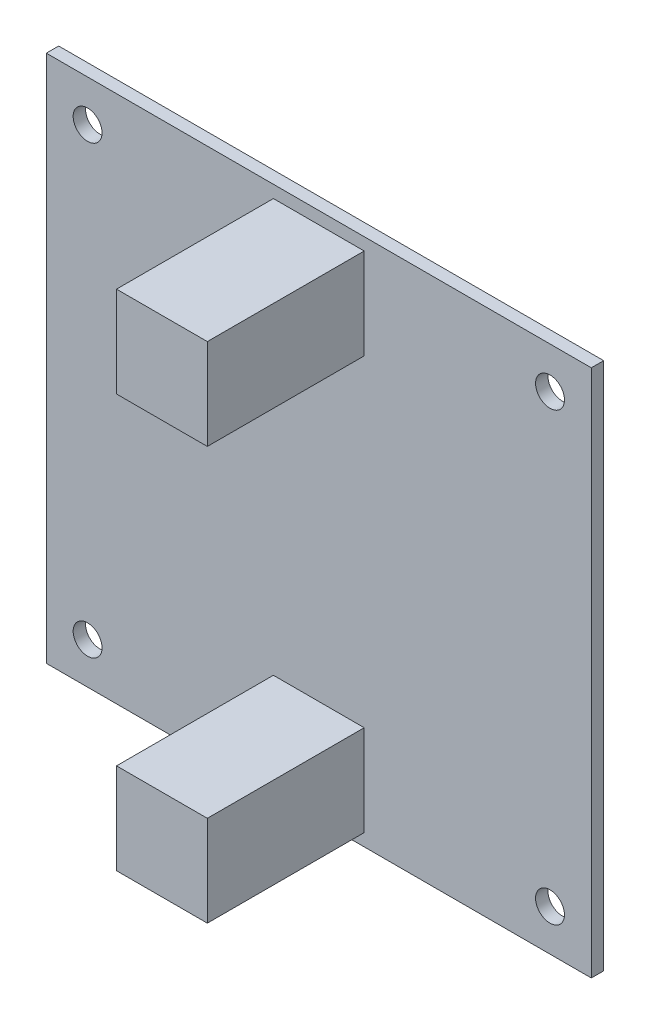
ISO-10303-21;
HEADER;
FILE_DESCRIPTION(('STEP AP214'),'2;1');
FILE_NAME('part.step','',(''),(''),'','','');
FILE_SCHEMA(('AUTOMOTIVE_DESIGN { 1 0 10303 214 1 1 1 1 }'));
ENDSEC;
DATA;
#1=APPLICATION_CONTEXT('core data for automotive mechanical design processes');
#2=APPLICATION_PROTOCOL_DEFINITION('international standard','automotive_design',2000,#1);
#3=PRODUCT_CONTEXT('',#1,'mechanical');
#4=PRODUCT('Part','Part','',(#3));
#5=PRODUCT_RELATED_PRODUCT_CATEGORY('part','',(#4));
#6=PRODUCT_DEFINITION_FORMATION('','',#4);
#7=PRODUCT_DEFINITION_CONTEXT('part definition',#1,'design');
#8=PRODUCT_DEFINITION('design','',#6,#7);
#9=PRODUCT_DEFINITION_SHAPE('','',#8);
#10=(LENGTH_UNIT() NAMED_UNIT(*) SI_UNIT(.MILLI.,.METRE.));
#11=(NAMED_UNIT(*) PLANE_ANGLE_UNIT() SI_UNIT($,.RADIAN.));
#12=(NAMED_UNIT(*) SI_UNIT($,.STERADIAN.) SOLID_ANGLE_UNIT());
#13=UNCERTAINTY_MEASURE_WITH_UNIT(LENGTH_MEASURE(1.E-05),#10,'distance_accuracy_value','');
#14=(GEOMETRIC_REPRESENTATION_CONTEXT(3) GLOBAL_UNCERTAINTY_ASSIGNED_CONTEXT((#13)) GLOBAL_UNIT_ASSIGNED_CONTEXT((#10,
#11,#12)) REPRESENTATION_CONTEXT('',''));
#15=CARTESIAN_POINT('',(0.,0.,0.));
#16=DIRECTION('',(0.,0.,1.));
#17=DIRECTION('',(1.,0.,0.));
#18=AXIS2_PLACEMENT_3D('',#15,#16,#17);
#19=CARTESIAN_POINT('',(0.,0.,1.5));
#20=DIRECTION('',(0.,0.,1.));
#21=DIRECTION('',(1.,0.,0.));
#22=AXIS2_PLACEMENT_3D('',#19,#20,#21);
#23=PLANE('',#22);
#24=DIRECTION('',(0.,-1.,0.));
#25=VECTOR('',#24,1.);
#26=CARTESIAN_POINT('',(5.49999999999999,-30.5,1.5));
#27=LINE('',#26,#25);
#28=CARTESIAN_POINT('',(5.5,-19.5,1.5));
#29=VERTEX_POINT('',#28);
#30=CARTESIAN_POINT('',(5.49999999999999,-30.5,1.5));
#31=VERTEX_POINT('',#30);
#32=EDGE_CURVE('E130',#29,#31,#27,.T.);
#33=ORIENTED_EDGE('',*,*,#32,.T.);
#34=DIRECTION('',(-1.,0.,0.));
#35=VECTOR('',#34,1.);
#36=CARTESIAN_POINT('',(-5.50000000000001,-30.5,1.5));
#37=LINE('',#36,#35);
#38=CARTESIAN_POINT('',(-5.50000000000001,-30.5,1.5));
#39=VERTEX_POINT('',#38);
#40=EDGE_CURVE('E144',#31,#39,#37,.T.);
#41=ORIENTED_EDGE('',*,*,#40,.T.);
#42=DIRECTION('',(0.,1.,0.));
#43=VECTOR('',#42,1.);
#44=CARTESIAN_POINT('',(-5.50000000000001,-30.5,1.5));
#45=LINE('',#44,#43);
#46=CARTESIAN_POINT('',(-5.50000000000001,-19.5,1.5));
#47=VERTEX_POINT('',#46);
#48=EDGE_CURVE('E56',#39,#47,#45,.T.);
#49=ORIENTED_EDGE('',*,*,#48,.T.);
#50=DIRECTION('',(1.,0.,0.));
#51=VECTOR('',#50,1.);
#52=CARTESIAN_POINT('',(-5.50000000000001,-19.5,1.5));
#53=LINE('',#52,#51);
#54=EDGE_CURVE('E51',#47,#29,#53,.T.);
#55=ORIENTED_EDGE('',*,*,#54,.T.);
#56=EDGE_LOOP('',(#33,#41,#49,#55));
#57=FACE_BOUND('',#56,.T.);
#58=CARTESIAN_POINT('',(-28.,-27.,1.5));
#59=DIRECTION('',(0.,0.,1.));
#60=DIRECTION('',(-1.,0.,0.));
#61=AXIS2_PLACEMENT_3D('',#58,#59,#60);
#62=CIRCLE('',#61,1.75);
#63=CARTESIAN_POINT('',(-29.75,-27.,1.5));
#64=VERTEX_POINT('',#63);
#65=EDGE_CURVE('E190',#64,#64,#62,.T.);
#66=ORIENTED_EDGE('',*,*,#65,.F.);
#67=EDGE_LOOP('',(#66));
#68=FACE_BOUND('',#67,.T.);
#69=CARTESIAN_POINT('',(28.,-27.,1.5));
#70=DIRECTION('',(0.,0.,1.));
#71=DIRECTION('',(1.,0.,0.));
#72=AXIS2_PLACEMENT_3D('',#69,#70,#71);
#73=CIRCLE('',#72,1.75);
#74=CARTESIAN_POINT('',(29.75,-27.,1.5));
#75=VERTEX_POINT('',#74);
#76=EDGE_CURVE('E199',#75,#75,#73,.T.);
#77=ORIENTED_EDGE('',*,*,#76,.F.);
#78=EDGE_LOOP('',(#77));
#79=FACE_BOUND('',#78,.T.);
#80=CARTESIAN_POINT('',(28.,27.,1.5));
#81=DIRECTION('',(0.,0.,1.));
#82=DIRECTION('',(-1.,0.,0.));
#83=AXIS2_PLACEMENT_3D('',#80,#81,#82);
#84=CIRCLE('',#83,1.75);
#85=CARTESIAN_POINT('',(26.25,27.,1.5));
#86=VERTEX_POINT('',#85);
#87=EDGE_CURVE('E191',#86,#86,#84,.T.);
#88=ORIENTED_EDGE('',*,*,#87,.F.);
#89=EDGE_LOOP('',(#88));
#90=FACE_BOUND('',#89,.T.);
#91=CARTESIAN_POINT('',(-28.,27.,1.5));
#92=DIRECTION('',(0.,0.,1.));
#93=DIRECTION('',(1.,0.,0.));
#94=AXIS2_PLACEMENT_3D('',#91,#92,#93);
#95=CIRCLE('',#94,1.75);
#96=CARTESIAN_POINT('',(-26.25,27.,1.5));
#97=VERTEX_POINT('',#96);
#98=EDGE_CURVE('E198',#97,#97,#95,.T.);
#99=ORIENTED_EDGE('',*,*,#98,.F.);
#100=EDGE_LOOP('',(#99));
#101=FACE_BOUND('',#100,.T.);
#102=DIRECTION('',(0.,1.,0.));
#103=VECTOR('',#102,1.);
#104=CARTESIAN_POINT('',(33.,32.,1.5));
#105=LINE('',#104,#103);
#106=CARTESIAN_POINT('',(33.,-32.,1.5));
#107=VERTEX_POINT('',#106);
#108=CARTESIAN_POINT('',(33.,32.,1.5));
#109=VERTEX_POINT('',#108);
#110=EDGE_CURVE('E215',#107,#109,#105,.T.);
#111=ORIENTED_EDGE('',*,*,#110,.T.);
#112=DIRECTION('',(-1.,0.,0.));
#113=VECTOR('',#112,1.);
#114=CARTESIAN_POINT('',(-33.,32.,1.5));
#115=LINE('',#114,#113);
#116=CARTESIAN_POINT('',(-33.,32.,1.5));
#117=VERTEX_POINT('',#116);
#118=EDGE_CURVE('E218',#109,#117,#115,.T.);
#119=ORIENTED_EDGE('',*,*,#118,.T.);
#120=DIRECTION('',(0.,-1.,0.));
#121=VECTOR('',#120,1.);
#122=CARTESIAN_POINT('',(-33.,32.,1.5));
#123=LINE('',#122,#121);
#124=CARTESIAN_POINT('',(-33.,-32.,1.5));
#125=VERTEX_POINT('',#124);
#126=EDGE_CURVE('E221',#117,#125,#123,.T.);
#127=ORIENTED_EDGE('',*,*,#126,.T.);
#128=DIRECTION('',(1.,0.,0.));
#129=VECTOR('',#128,1.);
#130=CARTESIAN_POINT('',(-33.,-32.,1.5));
#131=LINE('',#130,#129);
#132=EDGE_CURVE('E223',#125,#107,#131,.T.);
#133=ORIENTED_EDGE('',*,*,#132,.T.);
#134=EDGE_LOOP('',(#111,#119,#127,#133));
#135=FACE_BOUND('',#134,.T.);
#136=DIRECTION('',(-1.,0.,0.));
#137=VECTOR('',#136,1.);
#138=CARTESIAN_POINT('',(-5.50000000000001,30.5,1.5));
#139=LINE('',#138,#137);
#140=CARTESIAN_POINT('',(5.49999999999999,30.5,1.5));
#141=VERTEX_POINT('',#140);
#142=CARTESIAN_POINT('',(-5.50000000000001,30.5,1.5));
#143=VERTEX_POINT('',#142);
#144=EDGE_CURVE('E175',#141,#143,#139,.T.);
#145=ORIENTED_EDGE('',*,*,#144,.F.);
#146=DIRECTION('',(0.,1.,0.));
#147=VECTOR('',#146,1.);
#148=CARTESIAN_POINT('',(5.49999999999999,30.5,1.5));
#149=LINE('',#148,#147);
#150=CARTESIAN_POINT('',(5.5,19.5,1.5));
#151=VERTEX_POINT('',#150);
#152=EDGE_CURVE('E133',#151,#141,#149,.T.);
#153=ORIENTED_EDGE('',*,*,#152,.F.);
#154=DIRECTION('',(1.,0.,0.));
#155=VECTOR('',#154,1.);
#156=CARTESIAN_POINT('',(-5.50000000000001,19.5,1.5));
#157=LINE('',#156,#155);
#158=CARTESIAN_POINT('',(-5.50000000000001,19.5,1.5));
#159=VERTEX_POINT('',#158);
#160=EDGE_CURVE('E166',#159,#151,#157,.T.);
#161=ORIENTED_EDGE('',*,*,#160,.F.);
#162=DIRECTION('',(0.,-1.,0.));
#163=VECTOR('',#162,1.);
#164=CARTESIAN_POINT('',(-5.50000000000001,30.5,1.5));
#165=LINE('',#164,#163);
#166=EDGE_CURVE('E177',#143,#159,#165,.T.);
#167=ORIENTED_EDGE('',*,*,#166,.F.);
#168=EDGE_LOOP('',(#145,#153,#161,#167));
#169=FACE_BOUND('',#168,.T.);
#170=ADVANCED_FACE('F36',(#57,#68,#79,#90,#101,#135,#169),#23,.T.);
#171=CARTESIAN_POINT('',(33.,32.,1.5));
#172=DIRECTION('',(-1.,0.,0.));
#173=DIRECTION('',(0.,-1.,0.));
#174=AXIS2_PLACEMENT_3D('',#171,#172,#173);
#175=PLANE('',#174);
#176=DIRECTION('',(0.,1.,0.));
#177=VECTOR('',#176,1.);
#178=CARTESIAN_POINT('',(33.,32.,0.));
#179=LINE('',#178,#177);
#180=CARTESIAN_POINT('',(33.,-32.,0.));
#181=VERTEX_POINT('',#180);
#182=CARTESIAN_POINT('',(33.,32.,0.));
#183=VERTEX_POINT('',#182);
#184=EDGE_CURVE('E214',#181,#183,#179,.T.);
#185=ORIENTED_EDGE('',*,*,#184,.T.);
#186=DIRECTION('',(0.,0.,-1.));
#187=VECTOR('',#186,1.);
#188=CARTESIAN_POINT('',(33.,32.,1.5));
#189=LINE('',#188,#187);
#190=EDGE_CURVE('E11',#109,#183,#189,.T.);
#191=ORIENTED_EDGE('',*,*,#190,.F.);
#192=ORIENTED_EDGE('',*,*,#110,.F.);
#193=DIRECTION('',(0.,0.,-1.));
#194=VECTOR('',#193,1.);
#195=CARTESIAN_POINT('',(33.,-32.,1.5));
#196=LINE('',#195,#194);
#197=EDGE_CURVE('E225',#107,#181,#196,.T.);
#198=ORIENTED_EDGE('',*,*,#197,.T.);
#199=EDGE_LOOP('',(#185,#191,#192,#198));
#200=FACE_BOUND('',#199,.T.);
#201=ADVANCED_FACE('F38',(#200),#175,.F.);
#202=CARTESIAN_POINT('',(-33.,32.,1.5));
#203=DIRECTION('',(0.,-1.,0.));
#204=DIRECTION('',(0.,0.,-1.));
#205=AXIS2_PLACEMENT_3D('',#202,#203,#204);
#206=PLANE('',#205);
#207=DIRECTION('',(-1.,0.,0.));
#208=VECTOR('',#207,1.);
#209=CARTESIAN_POINT('',(-33.,32.,0.));
#210=LINE('',#209,#208);
#211=CARTESIAN_POINT('',(-33.,32.,0.));
#212=VERTEX_POINT('',#211);
#213=EDGE_CURVE('E228',#183,#212,#210,.T.);
#214=ORIENTED_EDGE('',*,*,#213,.T.);
#215=DIRECTION('',(0.,0.,-1.));
#216=VECTOR('',#215,1.);
#217=CARTESIAN_POINT('',(-33.,32.,1.5));
#218=LINE('',#217,#216);
#219=EDGE_CURVE('E44',#117,#212,#218,.T.);
#220=ORIENTED_EDGE('',*,*,#219,.F.);
#221=ORIENTED_EDGE('',*,*,#118,.F.);
#222=ORIENTED_EDGE('',*,*,#190,.T.);
#223=EDGE_LOOP('',(#214,#220,#221,#222));
#224=FACE_BOUND('',#223,.T.);
#225=ADVANCED_FACE('F258',(#224),#206,.F.);
#226=CARTESIAN_POINT('',(-33.,32.,1.5));
#227=DIRECTION('',(1.,0.,0.));
#228=DIRECTION('',(0.,1.,0.));
#229=AXIS2_PLACEMENT_3D('',#226,#227,#228);
#230=PLANE('',#229);
#231=DIRECTION('',(0.,-1.,0.));
#232=VECTOR('',#231,1.);
#233=CARTESIAN_POINT('',(-33.,32.,0.));
#234=LINE('',#233,#232);
#235=CARTESIAN_POINT('',(-33.,-32.,0.));
#236=VERTEX_POINT('',#235);
#237=EDGE_CURVE('E230',#212,#236,#234,.T.);
#238=ORIENTED_EDGE('',*,*,#237,.T.);
#239=DIRECTION('',(0.,0.,-1.));
#240=VECTOR('',#239,1.);
#241=CARTESIAN_POINT('',(-33.,-32.,1.5));
#242=LINE('',#241,#240);
#243=EDGE_CURVE('E235',#125,#236,#242,.T.);
#244=ORIENTED_EDGE('',*,*,#243,.F.);
#245=ORIENTED_EDGE('',*,*,#126,.F.);
#246=ORIENTED_EDGE('',*,*,#219,.T.);
#247=EDGE_LOOP('',(#238,#244,#245,#246));
#248=FACE_BOUND('',#247,.T.);
#249=ADVANCED_FACE('F242',(#248),#230,.F.);
#250=CARTESIAN_POINT('',(-33.,-32.,1.5));
#251=DIRECTION('',(0.,1.,0.));
#252=DIRECTION('',(0.,0.,1.));
#253=AXIS2_PLACEMENT_3D('',#250,#251,#252);
#254=PLANE('',#253);
#255=DIRECTION('',(1.,0.,0.));
#256=VECTOR('',#255,1.);
#257=CARTESIAN_POINT('',(-33.,-32.,0.));
#258=LINE('',#257,#256);
#259=EDGE_CURVE('E219',#236,#181,#258,.T.);
#260=ORIENTED_EDGE('',*,*,#259,.T.);
#261=ORIENTED_EDGE('',*,*,#197,.F.);
#262=ORIENTED_EDGE('',*,*,#132,.F.);
#263=ORIENTED_EDGE('',*,*,#243,.T.);
#264=EDGE_LOOP('',(#260,#261,#262,#263));
#265=FACE_BOUND('',#264,.T.);
#266=ADVANCED_FACE('F251',(#265),#254,.F.);
#267=CARTESIAN_POINT('',(0.,0.,0.));
#268=DIRECTION('',(0.,0.,1.));
#269=DIRECTION('',(1.,0.,0.));
#270=AXIS2_PLACEMENT_3D('',#267,#268,#269);
#271=PLANE('',#270);
#272=CARTESIAN_POINT('',(-28.,-27.,0.));
#273=DIRECTION('',(0.,0.,1.));
#274=DIRECTION('',(1.,0.,0.));
#275=AXIS2_PLACEMENT_3D('',#272,#273,#274);
#276=CIRCLE('',#275,1.75);
#277=CARTESIAN_POINT('',(-26.25,-27.,0.));
#278=VERTEX_POINT('',#277);
#279=EDGE_CURVE('E202',#278,#278,#276,.F.);
#280=ORIENTED_EDGE('',*,*,#279,.F.);
#281=EDGE_LOOP('',(#280));
#282=FACE_BOUND('',#281,.T.);
#283=CARTESIAN_POINT('',(28.,-27.,0.));
#284=DIRECTION('',(0.,0.,1.));
#285=DIRECTION('',(1.,0.,0.));
#286=AXIS2_PLACEMENT_3D('',#283,#284,#285);
#287=CIRCLE('',#286,1.75);
#288=CARTESIAN_POINT('',(29.75,-27.,0.));
#289=VERTEX_POINT('',#288);
#290=EDGE_CURVE('E195',#289,#289,#287,.F.);
#291=ORIENTED_EDGE('',*,*,#290,.F.);
#292=EDGE_LOOP('',(#291));
#293=FACE_BOUND('',#292,.T.);
#294=CARTESIAN_POINT('',(28.,27.,0.));
#295=DIRECTION('',(0.,0.,1.));
#296=DIRECTION('',(1.,0.,0.));
#297=AXIS2_PLACEMENT_3D('',#294,#295,#296);
#298=CIRCLE('',#297,1.75);
#299=CARTESIAN_POINT('',(29.75,27.,0.));
#300=VERTEX_POINT('',#299);
#301=EDGE_CURVE('E194',#300,#300,#298,.F.);
#302=ORIENTED_EDGE('',*,*,#301,.F.);
#303=EDGE_LOOP('',(#302));
#304=FACE_BOUND('',#303,.T.);
#305=CARTESIAN_POINT('',(-28.,27.,0.));
#306=DIRECTION('',(0.,0.,1.));
#307=DIRECTION('',(1.,0.,0.));
#308=AXIS2_PLACEMENT_3D('',#305,#306,#307);
#309=CIRCLE('',#308,1.75);
#310=CARTESIAN_POINT('',(-26.25,27.,0.));
#311=VERTEX_POINT('',#310);
#312=EDGE_CURVE('E211',#311,#311,#309,.F.);
#313=ORIENTED_EDGE('',*,*,#312,.F.);
#314=EDGE_LOOP('',(#313));
#315=FACE_BOUND('',#314,.T.);
#316=ORIENTED_EDGE('',*,*,#184,.F.);
#317=ORIENTED_EDGE('',*,*,#259,.F.);
#318=ORIENTED_EDGE('',*,*,#237,.F.);
#319=ORIENTED_EDGE('',*,*,#213,.F.);
#320=EDGE_LOOP('',(#316,#317,#318,#319));
#321=FACE_BOUND('',#320,.T.);
#322=ADVANCED_FACE('F248',(#282,#293,#304,#315,#321),#271,.F.);
#323=CARTESIAN_POINT('',(-28.,27.,-0.000999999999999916));
#324=DIRECTION('',(0.,0.,1.));
#325=DIRECTION('',(1.,0.,0.));
#326=AXIS2_PLACEMENT_3D('',#323,#324,#325);
#327=CYLINDRICAL_SURFACE('',#326,1.75);
#328=ORIENTED_EDGE('',*,*,#98,.T.);
#329=EDGE_LOOP('',(#328));
#330=FACE_BOUND('',#329,.T.);
#331=ORIENTED_EDGE('',*,*,#312,.T.);
#332=EDGE_LOOP('',(#331));
#333=FACE_BOUND('',#332,.T.);
#334=ADVANCED_FACE('F272',(#330,#333),#327,.F.);
#335=CARTESIAN_POINT('',(28.,27.,-0.000999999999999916));
#336=DIRECTION('',(0.,0.,1.));
#337=DIRECTION('',(1.,0.,0.));
#338=AXIS2_PLACEMENT_3D('',#335,#336,#337);
#339=CYLINDRICAL_SURFACE('',#338,1.75);
#340=ORIENTED_EDGE('',*,*,#87,.T.);
#341=EDGE_LOOP('',(#340));
#342=FACE_BOUND('',#341,.T.);
#343=ORIENTED_EDGE('',*,*,#301,.T.);
#344=EDGE_LOOP('',(#343));
#345=FACE_BOUND('',#344,.T.);
#346=ADVANCED_FACE('F292',(#342,#345),#339,.F.);
#347=CARTESIAN_POINT('',(28.,-27.,-0.000999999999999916));
#348=DIRECTION('',(0.,0.,1.));
#349=DIRECTION('',(1.,0.,0.));
#350=AXIS2_PLACEMENT_3D('',#347,#348,#349);
#351=CYLINDRICAL_SURFACE('',#350,1.75);
#352=ORIENTED_EDGE('',*,*,#76,.T.);
#353=EDGE_LOOP('',(#352));
#354=FACE_BOUND('',#353,.T.);
#355=ORIENTED_EDGE('',*,*,#290,.T.);
#356=EDGE_LOOP('',(#355));
#357=FACE_BOUND('',#356,.T.);
#358=ADVANCED_FACE('F299',(#354,#357),#351,.F.);
#359=CARTESIAN_POINT('',(-28.,-27.,-0.000999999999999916));
#360=DIRECTION('',(0.,0.,1.));
#361=DIRECTION('',(1.,0.,0.));
#362=AXIS2_PLACEMENT_3D('',#359,#360,#361);
#363=CYLINDRICAL_SURFACE('',#362,1.75);
#364=ORIENTED_EDGE('',*,*,#65,.T.);
#365=EDGE_LOOP('',(#364));
#366=FACE_BOUND('',#365,.T.);
#367=ORIENTED_EDGE('',*,*,#279,.T.);
#368=EDGE_LOOP('',(#367));
#369=FACE_BOUND('',#368,.T.);
#370=ADVANCED_FACE('F307',(#366,#369),#363,.F.);
#371=CARTESIAN_POINT('',(5.49999999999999,30.5,20.5));
#372=DIRECTION('',(-1.,0.,0.));
#373=DIRECTION('',(0.,-1.,0.));
#374=AXIS2_PLACEMENT_3D('',#371,#372,#373);
#375=PLANE('',#374);
#376=ORIENTED_EDGE('',*,*,#152,.T.);
#377=DIRECTION('',(0.,0.,-1.));
#378=VECTOR('',#377,1.);
#379=CARTESIAN_POINT('',(5.49999999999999,30.5,20.5));
#380=LINE('',#379,#378);
#381=CARTESIAN_POINT('',(5.49999999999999,30.5,20.5));
#382=VERTEX_POINT('',#381);
#383=EDGE_CURVE('E188',#382,#141,#380,.T.);
#384=ORIENTED_EDGE('',*,*,#383,.F.);
#385=DIRECTION('',(0.,1.,0.));
#386=VECTOR('',#385,1.);
#387=CARTESIAN_POINT('',(5.49999999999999,30.5,20.5));
#388=LINE('',#387,#386);
#389=CARTESIAN_POINT('',(5.5,19.5,20.5));
#390=VERTEX_POINT('',#389);
#391=EDGE_CURVE('E162',#390,#382,#388,.T.);
#392=ORIENTED_EDGE('',*,*,#391,.F.);
#393=DIRECTION('',(0.,0.,-1.));
#394=VECTOR('',#393,1.);
#395=CARTESIAN_POINT('',(5.5,19.5,20.5));
#396=LINE('',#395,#394);
#397=EDGE_CURVE('E172',#390,#151,#396,.T.);
#398=ORIENTED_EDGE('',*,*,#397,.T.);
#399=EDGE_LOOP('',(#376,#384,#392,#398));
#400=FACE_BOUND('',#399,.T.);
#401=ADVANCED_FACE('F315',(#400),#375,.F.);
#402=CARTESIAN_POINT('',(-5.50000000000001,30.5,20.5));
#403=DIRECTION('',(0.,-1.,0.));
#404=DIRECTION('',(0.,0.,-1.));
#405=AXIS2_PLACEMENT_3D('',#402,#403,#404);
#406=PLANE('',#405);
#407=ORIENTED_EDGE('',*,*,#144,.T.);
#408=DIRECTION('',(0.,0.,-1.));
#409=VECTOR('',#408,1.);
#410=CARTESIAN_POINT('',(-5.50000000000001,30.5,20.5));
#411=LINE('',#410,#409);
#412=CARTESIAN_POINT('',(-5.50000000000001,30.5,20.5));
#413=VERTEX_POINT('',#412);
#414=EDGE_CURVE('E185',#413,#143,#411,.T.);
#415=ORIENTED_EDGE('',*,*,#414,.F.);
#416=DIRECTION('',(-1.,0.,0.));
#417=VECTOR('',#416,1.);
#418=CARTESIAN_POINT('',(-5.50000000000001,30.5,20.5));
#419=LINE('',#418,#417);
#420=EDGE_CURVE('E165',#382,#413,#419,.T.);
#421=ORIENTED_EDGE('',*,*,#420,.F.);
#422=ORIENTED_EDGE('',*,*,#383,.T.);
#423=EDGE_LOOP('',(#407,#415,#421,#422));
#424=FACE_BOUND('',#423,.T.);
#425=ADVANCED_FACE('F322',(#424),#406,.F.);
#426=CARTESIAN_POINT('',(-5.50000000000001,30.5,20.5));
#427=DIRECTION('',(1.,0.,0.));
#428=DIRECTION('',(0.,1.,0.));
#429=AXIS2_PLACEMENT_3D('',#426,#427,#428);
#430=PLANE('',#429);
#431=ORIENTED_EDGE('',*,*,#166,.T.);
#432=DIRECTION('',(0.,0.,-1.));
#433=VECTOR('',#432,1.);
#434=CARTESIAN_POINT('',(-5.50000000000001,19.5,20.5));
#435=LINE('',#434,#433);
#436=CARTESIAN_POINT('',(-5.50000000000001,19.5,20.5));
#437=VERTEX_POINT('',#436);
#438=EDGE_CURVE('E183',#437,#159,#435,.T.);
#439=ORIENTED_EDGE('',*,*,#438,.F.);
#440=DIRECTION('',(0.,-1.,0.));
#441=VECTOR('',#440,1.);
#442=CARTESIAN_POINT('',(-5.50000000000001,30.5,20.5));
#443=LINE('',#442,#441);
#444=EDGE_CURVE('E168',#413,#437,#443,.T.);
#445=ORIENTED_EDGE('',*,*,#444,.F.);
#446=ORIENTED_EDGE('',*,*,#414,.T.);
#447=EDGE_LOOP('',(#431,#439,#445,#446));
#448=FACE_BOUND('',#447,.T.);
#449=ADVANCED_FACE('F330',(#448),#430,.F.);
#450=CARTESIAN_POINT('',(-5.50000000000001,19.5,20.5));
#451=DIRECTION('',(0.,1.,0.));
#452=DIRECTION('',(0.,0.,1.));
#453=AXIS2_PLACEMENT_3D('',#450,#451,#452);
#454=PLANE('',#453);
#455=ORIENTED_EDGE('',*,*,#160,.T.);
#456=ORIENTED_EDGE('',*,*,#397,.F.);
#457=DIRECTION('',(1.,0.,0.));
#458=VECTOR('',#457,1.);
#459=CARTESIAN_POINT('',(-5.50000000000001,19.5,20.5));
#460=LINE('',#459,#458);
#461=EDGE_CURVE('E170',#437,#390,#460,.T.);
#462=ORIENTED_EDGE('',*,*,#461,.F.);
#463=ORIENTED_EDGE('',*,*,#438,.T.);
#464=EDGE_LOOP('',(#455,#456,#462,#463));
#465=FACE_BOUND('',#464,.T.);
#466=ADVANCED_FACE('F338',(#465),#454,.F.);
#467=CARTESIAN_POINT('',(0.,0.,20.5));
#468=DIRECTION('',(0.,0.,1.));
#469=DIRECTION('',(1.,0.,0.));
#470=AXIS2_PLACEMENT_3D('',#467,#468,#469);
#471=PLANE('',#470);
#472=ORIENTED_EDGE('',*,*,#391,.T.);
#473=ORIENTED_EDGE('',*,*,#420,.T.);
#474=ORIENTED_EDGE('',*,*,#444,.T.);
#475=ORIENTED_EDGE('',*,*,#461,.T.);
#476=EDGE_LOOP('',(#472,#473,#474,#475));
#477=FACE_BOUND('',#476,.T.);
#478=ADVANCED_FACE('F346',(#477),#471,.T.);
#479=CARTESIAN_POINT('',(5.49999999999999,-30.5,20.5));
#480=DIRECTION('',(1.,0.,0.));
#481=DIRECTION('',(0.,1.,0.));
#482=AXIS2_PLACEMENT_3D('',#479,#480,#481);
#483=PLANE('',#482);
#484=ORIENTED_EDGE('',*,*,#32,.F.);
#485=DIRECTION('',(0.,0.,-1.));
#486=VECTOR('',#485,1.);
#487=CARTESIAN_POINT('',(5.5,-19.5,20.5));
#488=LINE('',#487,#486);
#489=CARTESIAN_POINT('',(5.5,-19.5,20.5));
#490=VERTEX_POINT('',#489);
#491=EDGE_CURVE('E124',#490,#29,#488,.T.);
#492=ORIENTED_EDGE('',*,*,#491,.F.);
#493=DIRECTION('',(0.,-1.,0.));
#494=VECTOR('',#493,1.);
#495=CARTESIAN_POINT('',(5.49999999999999,-30.5,20.5));
#496=LINE('',#495,#494);
#497=CARTESIAN_POINT('',(5.49999999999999,-30.5,20.5));
#498=VERTEX_POINT('',#497);
#499=EDGE_CURVE('E128',#490,#498,#496,.T.);
#500=ORIENTED_EDGE('',*,*,#499,.T.);
#501=DIRECTION('',(0.,0.,-1.));
#502=VECTOR('',#501,1.);
#503=CARTESIAN_POINT('',(5.49999999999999,-30.5,20.5));
#504=LINE('',#503,#502);
#505=EDGE_CURVE('E152',#498,#31,#504,.T.);
#506=ORIENTED_EDGE('',*,*,#505,.T.);
#507=EDGE_LOOP('',(#484,#492,#500,#506));
#508=FACE_BOUND('',#507,.T.);
#509=ADVANCED_FACE('F126',(#508),#483,.T.);
#510=CARTESIAN_POINT('',(-5.50000000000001,-19.5,20.5));
#511=DIRECTION('',(0.,1.,0.));
#512=DIRECTION('',(0.,0.,1.));
#513=AXIS2_PLACEMENT_3D('',#510,#511,#512);
#514=PLANE('',#513);
#515=ORIENTED_EDGE('',*,*,#54,.F.);
#516=DIRECTION('',(0.,0.,-1.));
#517=VECTOR('',#516,1.);
#518=CARTESIAN_POINT('',(-5.50000000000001,-19.5,20.5));
#519=LINE('',#518,#517);
#520=CARTESIAN_POINT('',(-5.50000000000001,-19.5,20.5));
#521=VERTEX_POINT('',#520);
#522=EDGE_CURVE('E134',#521,#47,#519,.T.);
#523=ORIENTED_EDGE('',*,*,#522,.F.);
#524=DIRECTION('',(1.,0.,0.));
#525=VECTOR('',#524,1.);
#526=CARTESIAN_POINT('',(-5.50000000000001,-19.5,20.5));
#527=LINE('',#526,#525);
#528=EDGE_CURVE('E140',#521,#490,#527,.T.);
#529=ORIENTED_EDGE('',*,*,#528,.T.);
#530=ORIENTED_EDGE('',*,*,#491,.T.);
#531=EDGE_LOOP('',(#515,#523,#529,#530));
#532=FACE_BOUND('',#531,.T.);
#533=ADVANCED_FACE('F146',(#532),#514,.T.);
#534=CARTESIAN_POINT('',(-5.50000000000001,-30.5,20.5));
#535=DIRECTION('',(-1.,0.,0.));
#536=DIRECTION('',(0.,-1.,0.));
#537=AXIS2_PLACEMENT_3D('',#534,#535,#536);
#538=PLANE('',#537);
#539=ORIENTED_EDGE('',*,*,#48,.F.);
#540=DIRECTION('',(0.,0.,-1.));
#541=VECTOR('',#540,1.);
#542=CARTESIAN_POINT('',(-5.50000000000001,-30.5,20.5));
#543=LINE('',#542,#541);
#544=CARTESIAN_POINT('',(-5.50000000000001,-30.5,20.5));
#545=VERTEX_POINT('',#544);
#546=EDGE_CURVE('E158',#545,#39,#543,.T.);
#547=ORIENTED_EDGE('',*,*,#546,.F.);
#548=DIRECTION('',(0.,1.,0.));
#549=VECTOR('',#548,1.);
#550=CARTESIAN_POINT('',(-5.50000000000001,-30.5,20.5));
#551=LINE('',#550,#549);
#552=EDGE_CURVE('E147',#545,#521,#551,.T.);
#553=ORIENTED_EDGE('',*,*,#552,.T.);
#554=ORIENTED_EDGE('',*,*,#522,.T.);
#555=EDGE_LOOP('',(#539,#547,#553,#554));
#556=FACE_BOUND('',#555,.T.);
#557=ADVANCED_FACE('F368',(#556),#538,.T.);
#558=CARTESIAN_POINT('',(-5.50000000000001,-30.5,20.5));
#559=DIRECTION('',(0.,-1.,0.));
#560=DIRECTION('',(0.,0.,-1.));
#561=AXIS2_PLACEMENT_3D('',#558,#559,#560);
#562=PLANE('',#561);
#563=ORIENTED_EDGE('',*,*,#40,.F.);
#564=ORIENTED_EDGE('',*,*,#505,.F.);
#565=DIRECTION('',(-1.,0.,0.));
#566=VECTOR('',#565,1.);
#567=CARTESIAN_POINT('',(-5.50000000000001,-30.5,20.5));
#568=LINE('',#567,#566);
#569=EDGE_CURVE('E143',#498,#545,#568,.T.);
#570=ORIENTED_EDGE('',*,*,#569,.T.);
#571=ORIENTED_EDGE('',*,*,#546,.T.);
#572=EDGE_LOOP('',(#563,#564,#570,#571));
#573=FACE_BOUND('',#572,.T.);
#574=ADVANCED_FACE('F376',(#573),#562,.T.);
#575=CARTESIAN_POINT('',(0.,0.,20.5));
#576=DIRECTION('',(0.,0.,1.));
#577=DIRECTION('',(1.,0.,0.));
#578=AXIS2_PLACEMENT_3D('',#575,#576,#577);
#579=PLANE('',#578);
#580=ORIENTED_EDGE('',*,*,#499,.F.);
#581=ORIENTED_EDGE('',*,*,#528,.F.);
#582=ORIENTED_EDGE('',*,*,#552,.F.);
#583=ORIENTED_EDGE('',*,*,#569,.F.);
#584=EDGE_LOOP('',(#580,#581,#582,#583));
#585=FACE_BOUND('',#584,.T.);
#586=ADVANCED_FACE('F138',(#585),#579,.T.);
#587=CLOSED_SHELL('',(#170,#201,#225,#249,#266,#322,#334,#346,#358,#370,#401,#425,#449,#466,
#478,#509,#533,#557,#574,#586));
#588=MANIFOLD_SOLID_BREP('B2',#587);
#589=ADVANCED_BREP_SHAPE_REPRESENTATION('',(#18,#588),#14);
#590=SHAPE_DEFINITION_REPRESENTATION(#9,#589);
ENDSEC;
END-ISO-10303-21;
